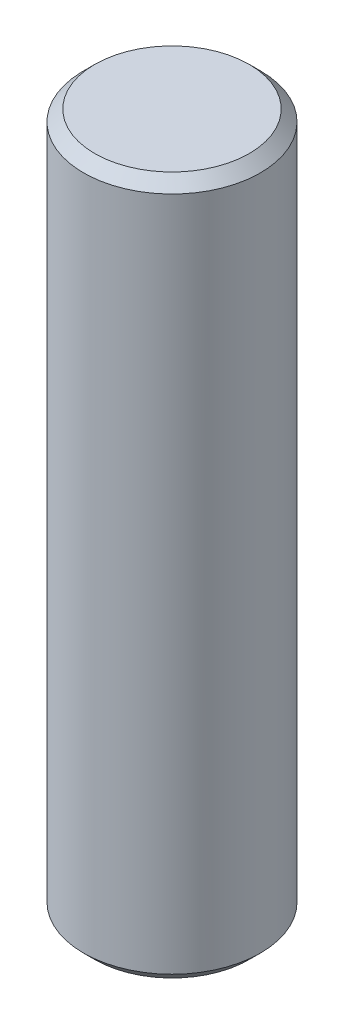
from build123d import *

# Parameters (mm, degrees)
SKETCH1_R      = 2.413
EXTRUDE1_DEPTH = 19.05
CHAMFER1_SIZE  = 0.3048


with BuildPart() as part:
    # Sketch1 → Extrude1 (new body)
    with BuildSketch(Plane(origin=(0, 0, 0), x_dir=(1, 0, 0), z_dir=(0, 1, 0))):
        with Locations(Location((0, 0, 0), (0, 0, 90))):
            Circle(SKETCH1_R)
    extrude(amount=EXTRUDE1_DEPTH)

    # Chamfer1
    chamfer1_edges = [part.edges().sort_by_distance(p)[0] for p in [
        (0, 0, 2.413),
        (0, 19.05, 2.413),
    ]]
    chamfer(chamfer1_edges, length=CHAMFER1_SIZE)


solid = part.part
